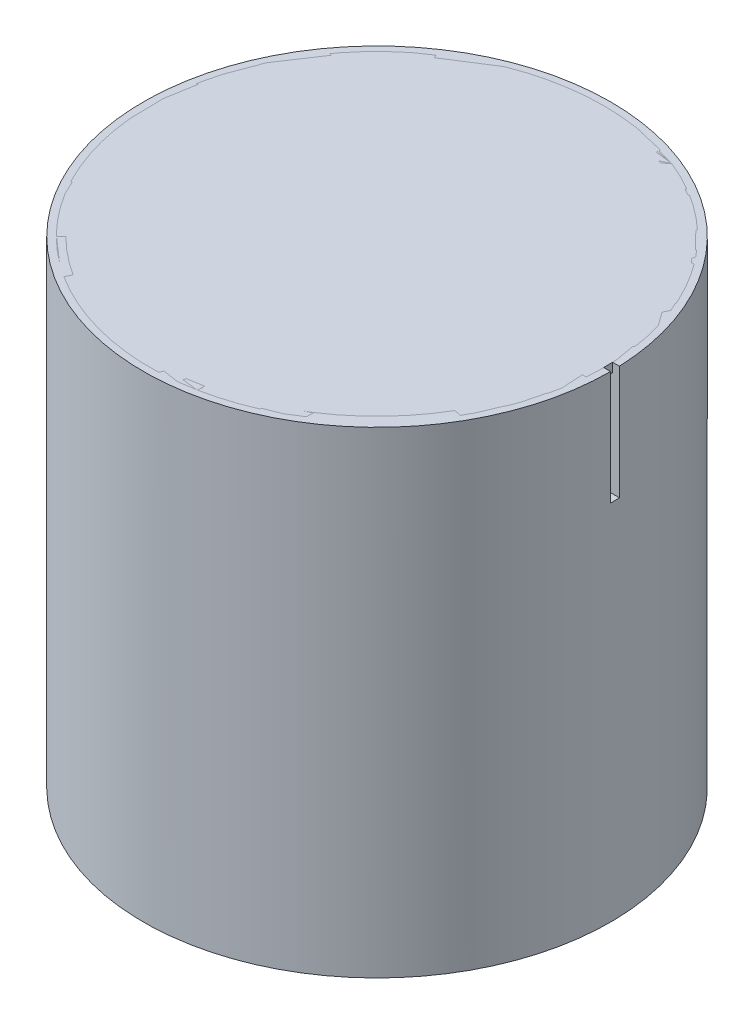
ISO-10303-21;
HEADER;
FILE_DESCRIPTION(('STEP AP214'),'2;1');
FILE_NAME('part.step','',(''),(''),'','','');
FILE_SCHEMA(('AUTOMOTIVE_DESIGN { 1 0 10303 214 1 1 1 1 }'));
ENDSEC;
DATA;
#1=APPLICATION_CONTEXT('core data for automotive mechanical design processes');
#2=APPLICATION_PROTOCOL_DEFINITION('international standard','automotive_design',2000,#1);
#3=PRODUCT_CONTEXT('',#1,'mechanical');
#4=PRODUCT('Part','Part','',(#3));
#5=PRODUCT_RELATED_PRODUCT_CATEGORY('part','',(#4));
#6=PRODUCT_DEFINITION_FORMATION('','',#4);
#7=PRODUCT_DEFINITION_CONTEXT('part definition',#1,'design');
#8=PRODUCT_DEFINITION('design','',#6,#7);
#9=PRODUCT_DEFINITION_SHAPE('','',#8);
#10=(LENGTH_UNIT() NAMED_UNIT(*) SI_UNIT(.MILLI.,.METRE.));
#11=(NAMED_UNIT(*) PLANE_ANGLE_UNIT() SI_UNIT($,.RADIAN.));
#12=(NAMED_UNIT(*) SI_UNIT($,.STERADIAN.) SOLID_ANGLE_UNIT());
#13=UNCERTAINTY_MEASURE_WITH_UNIT(LENGTH_MEASURE(1.E-05),#10,'distance_accuracy_value','');
#14=(GEOMETRIC_REPRESENTATION_CONTEXT(3) GLOBAL_UNCERTAINTY_ASSIGNED_CONTEXT((#13)) GLOBAL_UNIT_ASSIGNED_CONTEXT((#10,
#11,#12)) REPRESENTATION_CONTEXT('',''));
#15=CARTESIAN_POINT('',(0.,0.,0.));
#16=DIRECTION('',(0.,0.,1.));
#17=DIRECTION('',(1.,0.,0.));
#18=AXIS2_PLACEMENT_3D('',#15,#16,#17);
#19=CARTESIAN_POINT('',(0.,6.50000000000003,0.));
#20=DIRECTION('',(0.,1.,0.));
#21=DIRECTION('',(0.,0.,1.));
#22=AXIS2_PLACEMENT_3D('',#19,#20,#21);
#23=CONICAL_SURFACE('',#22,57.1,0.785398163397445);
#24=CARTESIAN_POINT('',(0.,2.9,0.));
#25=DIRECTION('',(0.,-1.,0.));
#26=DIRECTION('',(0.,0.,-1.));
#27=AXIS2_PLACEMENT_3D('',#24,#25,#26);
#28=CIRCLE('',#27,53.5);
#29=CARTESIAN_POINT('',(0.,2.9,-53.5));
#30=VERTEX_POINT('',#29);
#31=EDGE_CURVE('E11',#30,#30,#28,.T.);
#32=ORIENTED_EDGE('',*,*,#31,.T.);
#33=EDGE_LOOP('',(#32));
#34=FACE_BOUND('',#33,.T.);
#35=CARTESIAN_POINT('',(0.,6.50000000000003,0.));
#36=DIRECTION('',(0.,-1.,0.));
#37=DIRECTION('',(0.,0.,-1.));
#38=AXIS2_PLACEMENT_3D('',#35,#36,#37);
#39=CIRCLE('',#38,57.1);
#40=CARTESIAN_POINT('',(0.,6.50000000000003,-57.1));
#41=VERTEX_POINT('',#40);
#42=EDGE_CURVE('E68',#41,#41,#39,.T.);
#43=ORIENTED_EDGE('',*,*,#42,.F.);
#44=EDGE_LOOP('',(#43));
#45=FACE_BOUND('',#44,.T.);
#46=ADVANCED_FACE('F54',(#34,#45),#23,.F.);
#47=CARTESIAN_POINT('',(0.,14.4,0.));
#48=DIRECTION('',(0.,-1.,0.));
#49=DIRECTION('',(0.,0.,-1.));
#50=AXIS2_PLACEMENT_3D('',#47,#48,#49);
#51=CYLINDRICAL_SURFACE('',#50,53.5);
#52=CARTESIAN_POINT('',(0.,2.30000000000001,0.));
#53=DIRECTION('',(0.,-1.,0.));
#54=DIRECTION('',(0.,0.,-1.));
#55=AXIS2_PLACEMENT_3D('',#52,#53,#54);
#56=CIRCLE('',#55,53.5);
#57=CARTESIAN_POINT('',(0.,2.30000000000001,-53.5));
#58=VERTEX_POINT('',#57);
#59=EDGE_CURVE('E60',#58,#58,#56,.T.);
#60=ORIENTED_EDGE('',*,*,#59,.T.);
#61=EDGE_LOOP('',(#60));
#62=FACE_BOUND('',#61,.T.);
#63=ORIENTED_EDGE('',*,*,#31,.F.);
#64=EDGE_LOOP('',(#63));
#65=FACE_BOUND('',#64,.T.);
#66=ADVANCED_FACE('F78',(#62,#65),#51,.F.);
#67=CARTESIAN_POINT('',(0.,2.30000000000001,0.));
#68=DIRECTION('',(0.,-1.,0.));
#69=DIRECTION('',(0.,0.,-1.));
#70=AXIS2_PLACEMENT_3D('',#67,#68,#69);
#71=PLANE('',#70);
#72=CARTESIAN_POINT('',(0.,2.30000000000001,0.));
#73=DIRECTION('',(0.,-1.,0.));
#74=DIRECTION('',(0.,0.,-1.));
#75=AXIS2_PLACEMENT_3D('',#72,#73,#74);
#76=CIRCLE('',#75,57.1);
#77=CARTESIAN_POINT('',(0.,2.30000000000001,-57.1));
#78=VERTEX_POINT('',#77);
#79=EDGE_CURVE('E64',#78,#78,#76,.T.);
#80=ORIENTED_EDGE('',*,*,#79,.T.);
#81=EDGE_LOOP('',(#80));
#82=FACE_BOUND('',#81,.T.);
#83=ORIENTED_EDGE('',*,*,#59,.F.);
#84=EDGE_LOOP('',(#83));
#85=FACE_BOUND('',#84,.T.);
#86=ADVANCED_FACE('F82',(#82,#85),#71,.T.);
#87=CARTESIAN_POINT('',(0.,14.4,0.));
#88=DIRECTION('',(0.,-1.,0.));
#89=DIRECTION('',(0.,0.,-1.));
#90=AXIS2_PLACEMENT_3D('',#87,#88,#89);
#91=CYLINDRICAL_SURFACE('',#90,57.1);
#92=ORIENTED_EDGE('',*,*,#42,.T.);
#93=EDGE_LOOP('',(#92));
#94=FACE_BOUND('',#93,.T.);
#95=ORIENTED_EDGE('',*,*,#79,.F.);
#96=EDGE_LOOP('',(#95));
#97=FACE_BOUND('',#96,.T.);
#98=ADVANCED_FACE('F74',(#94,#97),#91,.T.);
#99=CLOSED_SHELL('',(#46,#66,#86,#98));
#100=MANIFOLD_SOLID_BREP('B2',#99);
#101=CARTESIAN_POINT('',(0.,2.4,0.));
#102=DIRECTION('',(0.,1.,0.));
#103=DIRECTION('',(-1.,0.,0.));
#104=AXIS2_PLACEMENT_3D('',#101,#102,#103);
#105=CYLINDRICAL_SURFACE('',#104,58.5);
#106=CARTESIAN_POINT('',(0.,2.40000000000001,0.));
#107=DIRECTION('',(0.,1.,0.));
#108=DIRECTION('',(-1.,0.,0.));
#109=AXIS2_PLACEMENT_3D('',#106,#107,#108);
#110=CIRCLE('',#109,58.5);
#111=CARTESIAN_POINT('',(-58.5,2.40000000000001,0.));
#112=VERTEX_POINT('',#111);
#113=EDGE_CURVE('E53',#112,#112,#110,.T.);
#114=ORIENTED_EDGE('',*,*,#113,.F.);
#115=EDGE_LOOP('',(#114));
#116=FACE_BOUND('',#115,.T.);
#117=CARTESIAN_POINT('',(0.,0.,0.));
#118=DIRECTION('',(0.,1.,0.));
#119=DIRECTION('',(-1.,0.,0.));
#120=AXIS2_PLACEMENT_3D('',#117,#118,#119);
#121=CIRCLE('',#120,58.5);
#122=CARTESIAN_POINT('',(-58.5,0.,0.));
#123=VERTEX_POINT('',#122);
#124=EDGE_CURVE('E130',#123,#123,#121,.T.);
#125=ORIENTED_EDGE('',*,*,#124,.T.);
#126=EDGE_LOOP('',(#125));
#127=FACE_BOUND('',#126,.T.);
#128=ADVANCED_FACE('F124',(#116,#127),#105,.T.);
#129=CARTESIAN_POINT('',(0.,2.40000000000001,0.));
#130=DIRECTION('',(0.,-1.,0.));
#131=DIRECTION('',(1.,0.,0.));
#132=AXIS2_PLACEMENT_3D('',#129,#130,#131);
#133=PLANE('',#132);
#134=ORIENTED_EDGE('',*,*,#113,.T.);
#135=EDGE_LOOP('',(#134));
#136=FACE_BOUND('',#135,.T.);
#137=ADVANCED_FACE('F139',(#136),#133,.F.);
#138=CARTESIAN_POINT('',(0.,0.,0.));
#139=DIRECTION('',(0.,1.,0.));
#140=DIRECTION('',(-1.,0.,0.));
#141=AXIS2_PLACEMENT_3D('',#138,#139,#140);
#142=PLANE('',#141);
#143=ORIENTED_EDGE('',*,*,#124,.F.);
#144=EDGE_LOOP('',(#143));
#145=FACE_BOUND('',#144,.T.);
#146=ADVANCED_FACE('F137',(#145),#142,.F.);
#147=CLOSED_SHELL('',(#128,#137,#146));
#148=MANIFOLD_SOLID_BREP('B6',#147);
#149=CARTESIAN_POINT('',(0.,35.6,0.));
#150=DIRECTION('',(0.,-1.,0.));
#151=DIRECTION('',(0.,0.,-1.));
#152=AXIS2_PLACEMENT_3D('',#149,#150,#151);
#153=PLANE('',#152);
#154=CARTESIAN_POINT('',(0.,35.6,0.));
#155=DIRECTION('',(0.,-1.,0.));
#156=DIRECTION('',(0.,0.,-1.));
#157=AXIS2_PLACEMENT_3D('',#154,#155,#156);
#158=CIRCLE('',#157,21.);
#159=CARTESIAN_POINT('',(0.,35.6,-21.));
#160=VERTEX_POINT('',#159);
#161=EDGE_CURVE('E123',#160,#160,#158,.T.);
#162=ORIENTED_EDGE('',*,*,#161,.T.);
#163=EDGE_LOOP('',(#162));
#164=FACE_BOUND('',#163,.T.);
#165=ADVANCED_FACE('F179',(#164),#153,.T.);
#166=CARTESIAN_POINT('',(0.,14.4,0.));
#167=DIRECTION('',(0.,-1.,0.));
#168=DIRECTION('',(0.,0.,-1.));
#169=AXIS2_PLACEMENT_3D('',#166,#167,#168);
#170=CYLINDRICAL_SURFACE('',#169,21.);
#171=CARTESIAN_POINT('',(0.,34.4,0.));
#172=DIRECTION('',(0.,-1.,0.));
#173=DIRECTION('',(0.,0.,-1.));
#174=AXIS2_PLACEMENT_3D('',#171,#172,#173);
#175=CIRCLE('',#174,21.);
#176=CARTESIAN_POINT('',(0.,34.4,-21.));
#177=VERTEX_POINT('',#176);
#178=EDGE_CURVE('E185',#177,#177,#175,.T.);
#179=ORIENTED_EDGE('',*,*,#178,.T.);
#180=EDGE_LOOP('',(#179));
#181=FACE_BOUND('',#180,.T.);
#182=ORIENTED_EDGE('',*,*,#161,.F.);
#183=EDGE_LOOP('',(#182));
#184=FACE_BOUND('',#183,.T.);
#185=ADVANCED_FACE('F211',(#181,#184),#170,.F.);
#186=CARTESIAN_POINT('',(0.,34.4,0.));
#187=DIRECTION('',(0.,-1.,0.));
#188=DIRECTION('',(0.,0.,-1.));
#189=AXIS2_PLACEMENT_3D('',#186,#187,#188);
#190=PLANE('',#189);
#191=CARTESIAN_POINT('',(0.,34.4,0.));
#192=DIRECTION('',(0.,-1.,0.));
#193=DIRECTION('',(0.,0.,-1.));
#194=AXIS2_PLACEMENT_3D('',#191,#192,#193);
#195=CIRCLE('',#194,60.3);
#196=CARTESIAN_POINT('',(0.,34.4,-60.3));
#197=VERTEX_POINT('',#196);
#198=EDGE_CURVE('E189',#197,#197,#195,.T.);
#199=ORIENTED_EDGE('',*,*,#198,.T.);
#200=EDGE_LOOP('',(#199));
#201=FACE_BOUND('',#200,.T.);
#202=ORIENTED_EDGE('',*,*,#178,.F.);
#203=EDGE_LOOP('',(#202));
#204=FACE_BOUND('',#203,.T.);
#205=ADVANCED_FACE('F207',(#201,#204),#190,.T.);
#206=CARTESIAN_POINT('',(0.,14.4,0.));
#207=DIRECTION('',(0.,-1.,0.));
#208=DIRECTION('',(0.,0.,-1.));
#209=AXIS2_PLACEMENT_3D('',#206,#207,#208);
#210=CYLINDRICAL_SURFACE('',#209,60.3);
#211=ORIENTED_EDGE('',*,*,#198,.F.);
#212=EDGE_LOOP('',(#211));
#213=FACE_BOUND('',#212,.T.);
#214=CARTESIAN_POINT('',(0.,36.8,0.));
#215=DIRECTION('',(0.,-1.,0.));
#216=DIRECTION('',(0.,0.,-1.));
#217=AXIS2_PLACEMENT_3D('',#214,#215,#216);
#218=CIRCLE('',#217,60.3);
#219=CARTESIAN_POINT('',(0.,36.8,-60.3));
#220=VERTEX_POINT('',#219);
#221=EDGE_CURVE('E193',#220,#220,#218,.T.);
#222=ORIENTED_EDGE('',*,*,#221,.T.);
#223=EDGE_LOOP('',(#222));
#224=FACE_BOUND('',#223,.T.);
#225=ADVANCED_FACE('F199',(#213,#224),#210,.T.);
#226=CARTESIAN_POINT('',(0.,36.8,0.));
#227=DIRECTION('',(0.,1.,0.));
#228=DIRECTION('',(0.,0.,1.));
#229=AXIS2_PLACEMENT_3D('',#226,#227,#228);
#230=PLANE('',#229);
#231=ORIENTED_EDGE('',*,*,#221,.F.);
#232=EDGE_LOOP('',(#231));
#233=FACE_BOUND('',#232,.T.);
#234=ADVANCED_FACE('F201',(#233),#230,.T.);
#235=CLOSED_SHELL('',(#165,#185,#205,#225,#234));
#236=MANIFOLD_SOLID_BREP('B48',#235);
#237=CARTESIAN_POINT('',(0.,36.8,0.));
#238=DIRECTION('',(0.,1.,0.));
#239=DIRECTION('',(-1.,0.,0.));
#240=AXIS2_PLACEMENT_3D('',#237,#238,#239);
#241=CYLINDRICAL_SURFACE('',#240,21.);
#242=CARTESIAN_POINT('',(0.,34.4,0.));
#243=DIRECTION('',(0.,1.,0.));
#244=DIRECTION('',(-1.,0.,0.));
#245=AXIS2_PLACEMENT_3D('',#242,#243,#244);
#246=CIRCLE('',#245,21.);
#247=CARTESIAN_POINT('',(-21.,34.4,0.));
#248=VERTEX_POINT('',#247);
#249=EDGE_CURVE('E268',#248,#248,#246,.T.);
#250=ORIENTED_EDGE('',*,*,#249,.T.);
#251=EDGE_LOOP('',(#250));
#252=FACE_BOUND('',#251,.T.);
#253=CARTESIAN_POINT('',(0.,35.6,0.));
#254=DIRECTION('',(0.,1.,0.));
#255=DIRECTION('',(-1.,0.,0.));
#256=AXIS2_PLACEMENT_3D('',#253,#254,#255);
#257=CIRCLE('',#256,21.);
#258=CARTESIAN_POINT('',(-21.,35.6,0.));
#259=VERTEX_POINT('',#258);
#260=EDGE_CURVE('E178',#259,#259,#257,.T.);
#261=ORIENTED_EDGE('',*,*,#260,.F.);
#262=EDGE_LOOP('',(#261));
#263=FACE_BOUND('',#262,.T.);
#264=ADVANCED_FACE('F262',(#252,#263),#241,.T.);
#265=CARTESIAN_POINT('',(0.,35.6,0.));
#266=DIRECTION('',(0.,1.,0.));
#267=DIRECTION('',(-1.,0.,0.));
#268=AXIS2_PLACEMENT_3D('',#265,#266,#267);
#269=PLANE('',#268);
#270=ORIENTED_EDGE('',*,*,#260,.T.);
#271=EDGE_LOOP('',(#270));
#272=FACE_BOUND('',#271,.T.);
#273=ADVANCED_FACE('F278',(#272),#269,.T.);
#274=CARTESIAN_POINT('',(0.,34.4,0.));
#275=DIRECTION('',(0.,1.,0.));
#276=DIRECTION('',(-1.,0.,0.));
#277=AXIS2_PLACEMENT_3D('',#274,#275,#276);
#278=PLANE('',#277);
#279=ORIENTED_EDGE('',*,*,#249,.F.);
#280=EDGE_LOOP('',(#279));
#281=FACE_BOUND('',#280,.T.);
#282=ADVANCED_FACE('F276',(#281),#278,.F.);
#283=CLOSED_SHELL('',(#264,#273,#282));
#284=MANIFOLD_SOLID_BREP('B118',#283);
#285=CARTESIAN_POINT('',(0.,36.8,0.));
#286=DIRECTION('',(0.,1.,0.));
#287=DIRECTION('',(0.,0.,1.));
#288=AXIS2_PLACEMENT_3D('',#285,#286,#287);
#289=PLANE('',#288);
#290=CARTESIAN_POINT('',(0.,36.8,0.));
#291=DIRECTION('',(0.,-1.,0.));
#292=DIRECTION('',(0.,0.,-1.));
#293=AXIS2_PLACEMENT_3D('',#290,#291,#292);
#294=CIRCLE('',#293,58.5);
#295=CARTESIAN_POINT('',(58.5,36.8,0.));
#296=VERTEX_POINT('',#295);
#297=CARTESIAN_POINT('',(58.4507484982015,36.8,-2.4));
#298=VERTEX_POINT('',#297);
#299=EDGE_CURVE('E260',#296,#298,#294,.T.);
#300=ORIENTED_EDGE('',*,*,#299,.T.);
#301=DIRECTION('',(1.,0.,0.));
#302=VECTOR('',#301,1.);
#303=CARTESIAN_POINT('',(0.,36.8,-2.4));
#304=LINE('',#303,#302);
#305=CARTESIAN_POINT('',(62.0536058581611,36.8,-2.4));
#306=VERTEX_POINT('',#305);
#307=EDGE_CURVE('E342',#298,#306,#304,.T.);
#308=ORIENTED_EDGE('',*,*,#307,.T.);
#309=CARTESIAN_POINT('',(0.,36.8,0.));
#310=DIRECTION('',(0.,-1.,0.));
#311=DIRECTION('',(0.,0.,-1.));
#312=AXIS2_PLACEMENT_3D('',#309,#310,#311);
#313=CIRCLE('',#312,62.1);
#314=CARTESIAN_POINT('',(62.1,36.8,0.));
#315=VERTEX_POINT('',#314);
#316=EDGE_CURVE('E367',#315,#306,#313,.T.);
#317=ORIENTED_EDGE('',*,*,#316,.F.);
#318=DIRECTION('',(1.,0.,0.));
#319=VECTOR('',#318,1.);
#320=CARTESIAN_POINT('',(0.,36.8,0.));
#321=LINE('',#320,#319);
#322=EDGE_CURVE('E395',#296,#315,#321,.T.);
#323=ORIENTED_EDGE('',*,*,#322,.F.);
#324=EDGE_LOOP('',(#300,#308,#317,#323));
#325=FACE_BOUND('',#324,.T.);
#326=ADVANCED_FACE('F303',(#325),#289,.T.);
#327=CARTESIAN_POINT('',(0.,14.4,0.));
#328=DIRECTION('',(0.,-1.,0.));
#329=DIRECTION('',(0.,0.,-1.));
#330=AXIS2_PLACEMENT_3D('',#327,#328,#329);
#331=CYLINDRICAL_SURFACE('',#330,58.5);
#332=CARTESIAN_POINT('',(0.,-90.,0.));
#333=DIRECTION('',(0.,-1.,0.));
#334=DIRECTION('',(0.,0.,-1.));
#335=AXIS2_PLACEMENT_3D('',#332,#333,#334);
#336=CIRCLE('',#335,58.5);
#337=CARTESIAN_POINT('',(0.,-90.,-58.5));
#338=VERTEX_POINT('',#337);
#339=EDGE_CURVE('E310',#338,#338,#336,.T.);
#340=ORIENTED_EDGE('',*,*,#339,.T.);
#341=EDGE_LOOP('',(#340));
#342=FACE_BOUND('',#341,.T.);
#343=DIRECTION('',(0.,1.,0.));
#344=VECTOR('',#343,1.);
#345=CARTESIAN_POINT('',(58.4507484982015,6.50000000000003,-2.4));
#346=LINE('',#345,#344);
#347=CARTESIAN_POINT('',(58.4507484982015,6.50000000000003,-2.4));
#348=VERTEX_POINT('',#347);
#349=EDGE_CURVE('E326',#348,#298,#346,.T.);
#350=ORIENTED_EDGE('',*,*,#349,.T.);
#351=ORIENTED_EDGE('',*,*,#299,.F.);
#352=DIRECTION('',(0.,1.,0.));
#353=VECTOR('',#352,1.);
#354=CARTESIAN_POINT('',(58.5,6.50000000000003,0.));
#355=LINE('',#354,#353);
#356=CARTESIAN_POINT('',(58.5,6.50000000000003,0.));
#357=VERTEX_POINT('',#356);
#358=EDGE_CURVE('E346',#357,#296,#355,.T.);
#359=ORIENTED_EDGE('',*,*,#358,.F.);
#360=CARTESIAN_POINT('',(0.,6.50000000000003,0.));
#361=DIRECTION('',(0.,1.,0.));
#362=DIRECTION('',(0.,0.,1.));
#363=AXIS2_PLACEMENT_3D('',#360,#361,#362);
#364=CIRCLE('',#363,58.5);
#365=EDGE_CURVE('E352',#348,#357,#364,.F.);
#366=ORIENTED_EDGE('',*,*,#365,.F.);
#367=EDGE_LOOP('',(#350,#351,#359,#366));
#368=FACE_BOUND('',#367,.T.);
#369=ADVANCED_FACE('F360',(#342,#368),#331,.F.);
#370=CARTESIAN_POINT('',(0.,14.4,0.));
#371=DIRECTION('',(0.,-1.,0.));
#372=DIRECTION('',(0.,0.,-1.));
#373=AXIS2_PLACEMENT_3D('',#370,#371,#372);
#374=CYLINDRICAL_SURFACE('',#373,62.1);
#375=CARTESIAN_POINT('',(0.,-90.,0.));
#376=DIRECTION('',(0.,-1.,0.));
#377=DIRECTION('',(0.,0.,-1.));
#378=AXIS2_PLACEMENT_3D('',#375,#376,#377);
#379=CIRCLE('',#378,62.1);
#380=CARTESIAN_POINT('',(0.,-90.,-62.1));
#381=VERTEX_POINT('',#380);
#382=EDGE_CURVE('E370',#381,#381,#379,.T.);
#383=ORIENTED_EDGE('',*,*,#382,.F.);
#384=EDGE_LOOP('',(#383));
#385=FACE_BOUND('',#384,.T.);
#386=ORIENTED_EDGE('',*,*,#316,.T.);
#387=DIRECTION('',(0.,1.,0.));
#388=VECTOR('',#387,1.);
#389=CARTESIAN_POINT('',(62.0536058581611,6.50000000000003,-2.4));
#390=LINE('',#389,#388);
#391=CARTESIAN_POINT('',(62.0536058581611,6.50000000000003,-2.4));
#392=VERTEX_POINT('',#391);
#393=EDGE_CURVE('E362',#392,#306,#390,.T.);
#394=ORIENTED_EDGE('',*,*,#393,.F.);
#395=CARTESIAN_POINT('',(0.,6.50000000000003,0.));
#396=DIRECTION('',(0.,1.,0.));
#397=DIRECTION('',(0.,0.,1.));
#398=AXIS2_PLACEMENT_3D('',#395,#396,#397);
#399=CIRCLE('',#398,62.1);
#400=CARTESIAN_POINT('',(62.1,6.50000000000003,0.));
#401=VERTEX_POINT('',#400);
#402=EDGE_CURVE('E351',#401,#392,#399,.T.);
#403=ORIENTED_EDGE('',*,*,#402,.F.);
#404=DIRECTION('',(0.,1.,0.));
#405=VECTOR('',#404,1.);
#406=CARTESIAN_POINT('',(62.1,6.50000000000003,0.));
#407=LINE('',#406,#405);
#408=EDGE_CURVE('E349',#401,#315,#407,.T.);
#409=ORIENTED_EDGE('',*,*,#408,.T.);
#410=EDGE_LOOP('',(#386,#394,#403,#409));
#411=FACE_BOUND('',#410,.T.);
#412=ADVANCED_FACE('F379',(#385,#411),#374,.T.);
#413=CARTESIAN_POINT('',(-3.46944695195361E-13,-90.,0.));
#414=DIRECTION('',(0.,-1.,0.));
#415=DIRECTION('',(0.,0.,-1.));
#416=AXIS2_PLACEMENT_3D('',#413,#414,#415);
#417=PLANE('',#416);
#418=ORIENTED_EDGE('',*,*,#382,.T.);
#419=EDGE_LOOP('',(#418));
#420=FACE_BOUND('',#419,.T.);
#421=ORIENTED_EDGE('',*,*,#339,.F.);
#422=EDGE_LOOP('',(#421));
#423=FACE_BOUND('',#422,.T.);
#424=ADVANCED_FACE('F376',(#420,#423),#417,.T.);
#425=CARTESIAN_POINT('',(0.,6.50000000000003,-2.4));
#426=DIRECTION('',(0.,0.,1.));
#427=DIRECTION('',(1.,0.,0.));
#428=AXIS2_PLACEMENT_3D('',#425,#426,#427);
#429=PLANE('',#428);
#430=ORIENTED_EDGE('',*,*,#307,.F.);
#431=ORIENTED_EDGE('',*,*,#349,.F.);
#432=DIRECTION('',(1.,0.,0.));
#433=VECTOR('',#432,1.);
#434=CARTESIAN_POINT('',(0.,6.50000000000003,-2.4));
#435=LINE('',#434,#433);
#436=EDGE_CURVE('E356',#348,#392,#435,.T.);
#437=ORIENTED_EDGE('',*,*,#436,.T.);
#438=ORIENTED_EDGE('',*,*,#393,.T.);
#439=EDGE_LOOP('',(#430,#431,#437,#438));
#440=FACE_BOUND('',#439,.T.);
#441=ADVANCED_FACE('F378',(#440),#429,.T.);
#442=CARTESIAN_POINT('',(0.,6.50000000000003,0.));
#443=DIRECTION('',(0.,0.,1.));
#444=DIRECTION('',(1.,0.,0.));
#445=AXIS2_PLACEMENT_3D('',#442,#443,#444);
#446=PLANE('',#445);
#447=ORIENTED_EDGE('',*,*,#322,.T.);
#448=ORIENTED_EDGE('',*,*,#408,.F.);
#449=DIRECTION('',(1.,0.,0.));
#450=VECTOR('',#449,1.);
#451=CARTESIAN_POINT('',(0.,6.50000000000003,0.));
#452=LINE('',#451,#450);
#453=EDGE_CURVE('E317',#357,#401,#452,.T.);
#454=ORIENTED_EDGE('',*,*,#453,.F.);
#455=ORIENTED_EDGE('',*,*,#358,.T.);
#456=EDGE_LOOP('',(#447,#448,#454,#455));
#457=FACE_BOUND('',#456,.T.);
#458=ADVANCED_FACE('F344',(#457),#446,.F.);
#459=CARTESIAN_POINT('',(0.,6.50000000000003,0.));
#460=DIRECTION('',(0.,1.,0.));
#461=DIRECTION('',(0.,0.,1.));
#462=AXIS2_PLACEMENT_3D('',#459,#460,#461);
#463=PLANE('',#462);
#464=ORIENTED_EDGE('',*,*,#365,.T.);
#465=ORIENTED_EDGE('',*,*,#453,.T.);
#466=ORIENTED_EDGE('',*,*,#402,.T.);
#467=ORIENTED_EDGE('',*,*,#436,.F.);
#468=EDGE_LOOP('',(#464,#465,#466,#467));
#469=FACE_BOUND('',#468,.T.);
#470=ADVANCED_FACE('F355',(#469),#463,.T.);
#471=CLOSED_SHELL('',(#326,#369,#412,#424,#441,#458,#470));
#472=MANIFOLD_SOLID_BREP('B173',#471);
#473=ADVANCED_BREP_SHAPE_REPRESENTATION('',(#18,#100,#148,#236,#284,#472),#14);
#474=SHAPE_DEFINITION_REPRESENTATION(#9,#473);
ENDSEC;
END-ISO-10303-21;
